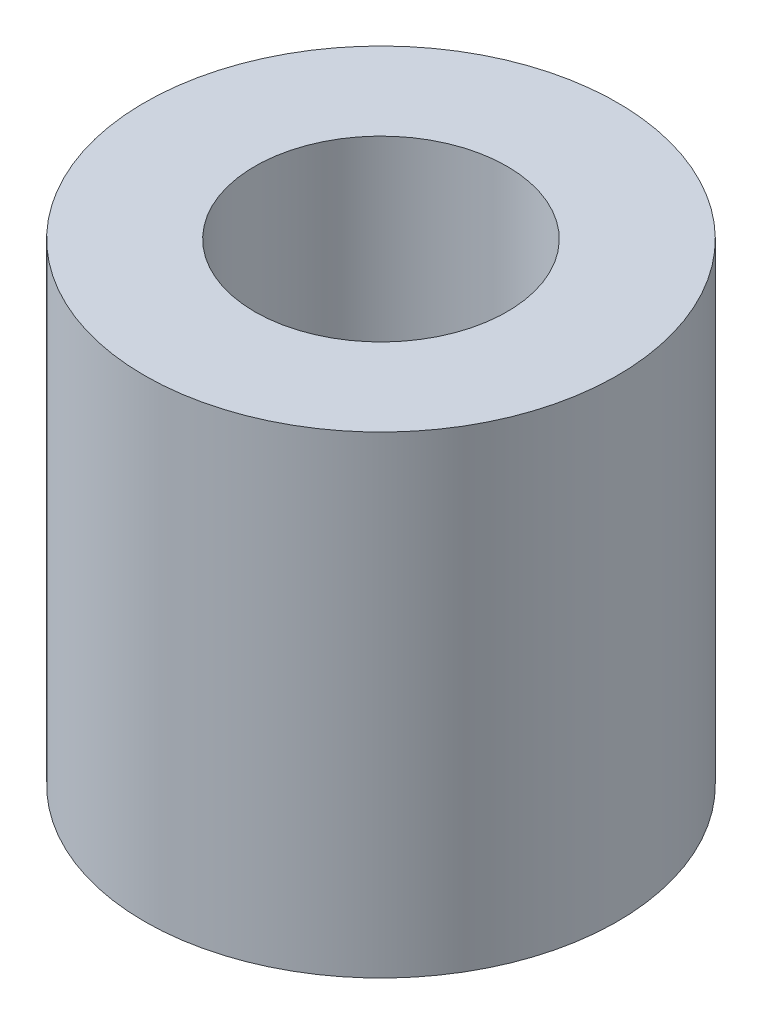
from build123d import *

# Parameters (mm, degrees)
SKETCH_1_R      = 3
SKETCH_1_R_2    = 1.6
EXTRUDE_1_DEPTH = 6


with BuildPart() as part:
    # Sketch 1 → Extrude 1 (new body)
    with BuildSketch(Plane(origin=(0, 0, 0), x_dir=(1, 0, 0), z_dir=(0, 1, 0))):
        with Locations(Location((0, 0, 0), (0, 0, 270))):
            Circle(SKETCH_1_R)
        with Locations(Location((0, 0, 0), (0, 0, 270))):
            Circle(SKETCH_1_R_2, mode=Mode.SUBTRACT)
    extrude(amount=EXTRUDE_1_DEPTH)


solid = part.part
